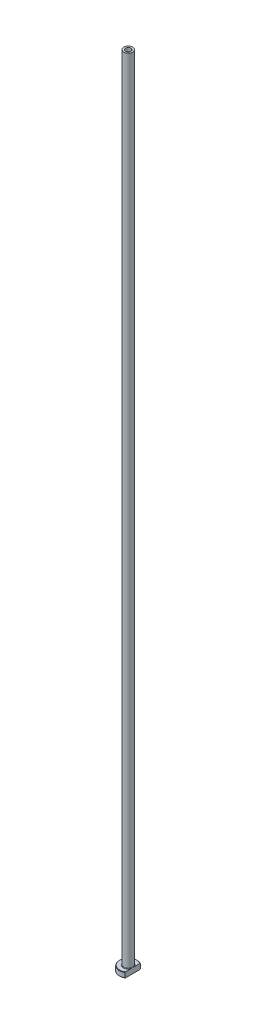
ISO-10303-21;
HEADER;
FILE_DESCRIPTION(('STEP AP214'),'2;1');
FILE_NAME('part.step','',(''),(''),'','','');
FILE_SCHEMA(('AUTOMOTIVE_DESIGN { 1 0 10303 214 1 1 1 1 }'));
ENDSEC;
DATA;
#1=APPLICATION_CONTEXT('core data for automotive mechanical design processes');
#2=APPLICATION_PROTOCOL_DEFINITION('international standard','automotive_design',2000,#1);
#3=PRODUCT_CONTEXT('',#1,'mechanical');
#4=PRODUCT('Part','Part','',(#3));
#5=PRODUCT_RELATED_PRODUCT_CATEGORY('part','',(#4));
#6=PRODUCT_DEFINITION_FORMATION('','',#4);
#7=PRODUCT_DEFINITION_CONTEXT('part definition',#1,'design');
#8=PRODUCT_DEFINITION('design','',#6,#7);
#9=PRODUCT_DEFINITION_SHAPE('','',#8);
#10=(LENGTH_UNIT() NAMED_UNIT(*) SI_UNIT(.MILLI.,.METRE.));
#11=(NAMED_UNIT(*) PLANE_ANGLE_UNIT() SI_UNIT($,.RADIAN.));
#12=(NAMED_UNIT(*) SI_UNIT($,.STERADIAN.) SOLID_ANGLE_UNIT());
#13=UNCERTAINTY_MEASURE_WITH_UNIT(LENGTH_MEASURE(1.E-05),#10,'distance_accuracy_value','');
#14=(GEOMETRIC_REPRESENTATION_CONTEXT(3) GLOBAL_UNCERTAINTY_ASSIGNED_CONTEXT((#13)) GLOBAL_UNIT_ASSIGNED_CONTEXT((#10,
#11,#12)) REPRESENTATION_CONTEXT('',''));
#15=CARTESIAN_POINT('',(0.,0.,0.));
#16=DIRECTION('',(0.,0.,1.));
#17=DIRECTION('',(1.,0.,0.));
#18=AXIS2_PLACEMENT_3D('',#15,#16,#17);
#19=CARTESIAN_POINT('',(0.,92.1876809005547,0.));
#20=DIRECTION('',(0.,1.,0.));
#21=DIRECTION('',(0.,0.,1.));
#22=AXIS2_PLACEMENT_3D('',#19,#20,#21);
#23=CYLINDRICAL_SURFACE('',#22,1.50000000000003);
#24=CARTESIAN_POINT('',(0.,450.,0.));
#25=DIRECTION('',(0.,1.,0.));
#26=DIRECTION('',(0.,0.,1.));
#27=AXIS2_PLACEMENT_3D('',#24,#25,#26);
#28=CIRCLE('',#27,1.50000000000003);
#29=CARTESIAN_POINT('',(0.,450.,1.50000000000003));
#30=VERTEX_POINT('',#29);
#31=EDGE_CURVE('E167',#30,#30,#28,.T.);
#32=ORIENTED_EDGE('',*,*,#31,.T.);
#33=EDGE_LOOP('',(#32));
#34=FACE_BOUND('',#33,.T.);
#35=CARTESIAN_POINT('',(0.,405.,0.));
#36=DIRECTION('',(0.,1.,0.));
#37=DIRECTION('',(0.,0.,1.));
#38=AXIS2_PLACEMENT_3D('',#35,#36,#37);
#39=CIRCLE('',#38,1.50000000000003);
#40=CARTESIAN_POINT('',(0.,405.,1.50000000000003));
#41=VERTEX_POINT('',#40);
#42=EDGE_CURVE('E170',#41,#41,#39,.T.);
#43=ORIENTED_EDGE('',*,*,#42,.F.);
#44=EDGE_LOOP('',(#43));
#45=FACE_BOUND('',#44,.T.);
#46=ADVANCED_FACE('F32',(#34,#45),#23,.F.);
#47=CARTESIAN_POINT('',(-1.50000000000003,450.,0.));
#48=DIRECTION('',(0.,1.,0.));
#49=DIRECTION('',(0.,0.,1.));
#50=AXIS2_PLACEMENT_3D('',#47,#48,#49);
#51=PLANE('',#50);
#52=CARTESIAN_POINT('',(0.,450.,0.));
#53=DIRECTION('',(0.,1.,0.));
#54=DIRECTION('',(0.,0.,1.));
#55=AXIS2_PLACEMENT_3D('',#52,#53,#54);
#56=CIRCLE('',#55,2.50000000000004);
#57=CARTESIAN_POINT('',(0.,450.,2.50000000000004));
#58=VERTEX_POINT('',#57);
#59=EDGE_CURVE('E174',#58,#58,#56,.T.);
#60=ORIENTED_EDGE('',*,*,#59,.T.);
#61=EDGE_LOOP('',(#60));
#62=FACE_BOUND('',#61,.T.);
#63=ORIENTED_EDGE('',*,*,#31,.F.);
#64=EDGE_LOOP('',(#63));
#65=FACE_BOUND('',#64,.T.);
#66=ADVANCED_FACE('F157',(#62,#65),#51,.T.);
#67=CARTESIAN_POINT('',(0.,92.1876809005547,0.));
#68=DIRECTION('',(0.,1.,0.));
#69=DIRECTION('',(0.,0.,1.));
#70=AXIS2_PLACEMENT_3D('',#67,#68,#69);
#71=CYLINDRICAL_SURFACE('',#70,2.50000000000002);
#72=CARTESIAN_POINT('',(0.,3.3,0.));
#73=DIRECTION('',(0.,1.,0.));
#74=DIRECTION('',(0.,0.,1.));
#75=AXIS2_PLACEMENT_3D('',#72,#73,#74);
#76=CIRCLE('',#75,2.50000000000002);
#77=CARTESIAN_POINT('',(2.50000000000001,3.3,0.));
#78=VERTEX_POINT('',#77);
#79=EDGE_CURVE('E180',#78,#78,#76,.T.);
#80=ORIENTED_EDGE('',*,*,#79,.T.);
#81=EDGE_LOOP('',(#80));
#82=FACE_BOUND('',#81,.T.);
#83=ORIENTED_EDGE('',*,*,#59,.F.);
#84=EDGE_LOOP('',(#83));
#85=FACE_BOUND('',#84,.T.);
#86=ADVANCED_FACE('F162',(#82,#85),#71,.T.);
#87=CARTESIAN_POINT('',(-2.49999999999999,3.,0.));
#88=DIRECTION('',(0.,1.,0.));
#89=DIRECTION('',(0.,0.,1.));
#90=AXIS2_PLACEMENT_3D('',#87,#88,#89);
#91=PLANE('',#90);
#92=DIRECTION('',(0.,0.,1.));
#93=VECTOR('',#92,1.);
#94=CARTESIAN_POINT('',(2.5,3.,0.));
#95=LINE('',#94,#93);
#96=CARTESIAN_POINT('',(2.5,3.,-4.09756024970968));
#97=VERTEX_POINT('',#96);
#98=CARTESIAN_POINT('',(2.5,3.,-1.26095202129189));
#99=VERTEX_POINT('',#98);
#100=EDGE_CURVE('E54',#97,#99,#95,.T.);
#101=ORIENTED_EDGE('',*,*,#100,.F.);
#102=CARTESIAN_POINT('',(0.,3.,0.));
#103=DIRECTION('',(0.,1.,0.));
#104=DIRECTION('',(0.,0.,1.));
#105=AXIS2_PLACEMENT_3D('',#102,#103,#104);
#106=CIRCLE('',#105,4.80000000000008);
#107=CARTESIAN_POINT('',(2.49999999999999,3.,4.09756024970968));
#108=VERTEX_POINT('',#107);
#109=EDGE_CURVE('E186',#97,#108,#106,.T.);
#110=ORIENTED_EDGE('',*,*,#109,.T.);
#111=CARTESIAN_POINT('',(2.5,3.,1.2609520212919));
#112=VERTEX_POINT('',#111);
#113=EDGE_CURVE('E134',#112,#108,#95,.T.);
#114=ORIENTED_EDGE('',*,*,#113,.F.);
#115=CARTESIAN_POINT('',(0.,3.,0.));
#116=DIRECTION('',(0.,1.,0.));
#117=DIRECTION('',(0.,0.,1.));
#118=AXIS2_PLACEMENT_3D('',#115,#116,#117);
#119=CIRCLE('',#118,2.80000000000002);
#120=EDGE_CURVE('E183',#112,#99,#119,.F.);
#121=ORIENTED_EDGE('',*,*,#120,.T.);
#122=EDGE_LOOP('',(#101,#110,#114,#121));
#123=FACE_BOUND('',#122,.T.);
#124=ADVANCED_FACE('F197',(#123),#91,.T.);
#125=CARTESIAN_POINT('',(0.,92.1876809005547,0.));
#126=DIRECTION('',(0.,1.,0.));
#127=DIRECTION('',(0.,0.,1.));
#128=AXIS2_PLACEMENT_3D('',#125,#126,#127);
#129=CYLINDRICAL_SURFACE('',#128,4.99999999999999);
#130=DIRECTION('',(0.,-1.,0.));
#131=VECTOR('',#130,1.);
#132=CARTESIAN_POINT('',(2.49999999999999,450.,4.33012701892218));
#133=LINE('',#132,#131);
#134=CARTESIAN_POINT('',(2.49999999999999,2.80000000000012,4.33012701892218));
#135=VERTEX_POINT('',#134);
#136=CARTESIAN_POINT('',(2.49999999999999,0.200000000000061,4.33012701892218));
#137=VERTEX_POINT('',#136);
#138=EDGE_CURVE('E82',#135,#137,#133,.T.);
#139=ORIENTED_EDGE('',*,*,#138,.F.);
#140=CARTESIAN_POINT('',(0.,2.80000000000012,0.));
#141=DIRECTION('',(0.,1.,0.));
#142=DIRECTION('',(0.,0.,1.));
#143=AXIS2_PLACEMENT_3D('',#140,#141,#142);
#144=CIRCLE('',#143,4.99999999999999);
#145=CARTESIAN_POINT('',(2.5,2.80000000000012,-4.33012701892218));
#146=VERTEX_POINT('',#145);
#147=EDGE_CURVE('E95',#135,#146,#144,.F.);
#148=ORIENTED_EDGE('',*,*,#147,.T.);
#149=DIRECTION('',(0.,-1.,0.));
#150=VECTOR('',#149,1.);
#151=CARTESIAN_POINT('',(2.5,450.,-4.33012701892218));
#152=LINE('',#151,#150);
#153=CARTESIAN_POINT('',(2.5,0.200000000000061,-4.33012701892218));
#154=VERTEX_POINT('',#153);
#155=EDGE_CURVE('E192',#146,#154,#152,.T.);
#156=ORIENTED_EDGE('',*,*,#155,.T.);
#157=CARTESIAN_POINT('',(0.,0.200000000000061,0.));
#158=DIRECTION('',(0.,-1.,0.));
#159=DIRECTION('',(0.,0.,-1.));
#160=AXIS2_PLACEMENT_3D('',#157,#158,#159);
#161=CIRCLE('',#160,4.99999999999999);
#162=EDGE_CURVE('E98',#154,#137,#161,.F.);
#163=ORIENTED_EDGE('',*,*,#162,.T.);
#164=EDGE_LOOP('',(#139,#148,#156,#163));
#165=FACE_BOUND('',#164,.T.);
#166=ADVANCED_FACE('F190',(#165),#129,.T.);
#167=CARTESIAN_POINT('',(-4.99999999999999,0.,0.));
#168=DIRECTION('',(0.,-1.,0.));
#169=DIRECTION('',(0.,0.,-1.));
#170=AXIS2_PLACEMENT_3D('',#167,#168,#169);
#171=PLANE('',#170);
#172=CARTESIAN_POINT('',(0.,0.,0.));
#173=DIRECTION('',(0.,-1.,0.));
#174=DIRECTION('',(0.,0.,-1.));
#175=AXIS2_PLACEMENT_3D('',#172,#173,#174);
#176=CIRCLE('',#175,2.24999999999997);
#177=CARTESIAN_POINT('',(0.,0.,-2.24999999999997));
#178=VERTEX_POINT('',#177);
#179=EDGE_CURVE('E40',#178,#178,#176,.F.);
#180=ORIENTED_EDGE('',*,*,#179,.T.);
#181=EDGE_LOOP('',(#180));
#182=FACE_BOUND('',#181,.T.);
#183=DIRECTION('',(0.,0.,-1.));
#184=VECTOR('',#183,1.);
#185=CARTESIAN_POINT('',(2.49999999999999,0.,4.33012701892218));
#186=LINE('',#185,#184);
#187=CARTESIAN_POINT('',(2.49999999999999,0.,4.09756024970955));
#188=VERTEX_POINT('',#187);
#189=CARTESIAN_POINT('',(2.5,0.,-4.09756024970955));
#190=VERTEX_POINT('',#189);
#191=EDGE_CURVE('E47',#188,#190,#186,.T.);
#192=ORIENTED_EDGE('',*,*,#191,.F.);
#193=CARTESIAN_POINT('',(0.,0.,0.));
#194=DIRECTION('',(0.,-1.,0.));
#195=DIRECTION('',(0.,0.,-1.));
#196=AXIS2_PLACEMENT_3D('',#193,#194,#195);
#197=CIRCLE('',#196,4.79999999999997);
#198=EDGE_CURVE('E92',#188,#190,#197,.T.);
#199=ORIENTED_EDGE('',*,*,#198,.T.);
#200=EDGE_LOOP('',(#192,#199));
#201=FACE_BOUND('',#200,.T.);
#202=ADVANCED_FACE('F91',(#182,#201),#171,.T.);
#203=CARTESIAN_POINT('',(0.,92.1876809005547,0.));
#204=DIRECTION('',(0.,1.,0.));
#205=DIRECTION('',(0.,0.,1.));
#206=AXIS2_PLACEMENT_3D('',#203,#204,#205);
#207=CYLINDRICAL_SURFACE('',#206,1.75000000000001);
#208=CARTESIAN_POINT('',(0.,0.499999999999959,0.));
#209=DIRECTION('',(0.,-1.,0.));
#210=DIRECTION('',(0.,0.,-1.));
#211=AXIS2_PLACEMENT_3D('',#208,#209,#210);
#212=CIRCLE('',#211,1.75000000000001);
#213=CARTESIAN_POINT('',(0.,0.499999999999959,-1.75000000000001));
#214=VERTEX_POINT('',#213);
#215=EDGE_CURVE('E11',#214,#214,#212,.T.);
#216=ORIENTED_EDGE('',*,*,#215,.T.);
#217=EDGE_LOOP('',(#216));
#218=FACE_BOUND('',#217,.T.);
#219=CARTESIAN_POINT('',(0.,393.,0.));
#220=DIRECTION('',(0.,1.,0.));
#221=DIRECTION('',(0.,0.,1.));
#222=AXIS2_PLACEMENT_3D('',#219,#220,#221);
#223=CIRCLE('',#222,1.75000000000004);
#224=CARTESIAN_POINT('',(0.,393.,1.75000000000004));
#225=VERTEX_POINT('',#224);
#226=EDGE_CURVE('E172',#225,#225,#223,.T.);
#227=ORIENTED_EDGE('',*,*,#226,.T.);
#228=EDGE_LOOP('',(#227));
#229=FACE_BOUND('',#228,.T.);
#230=ADVANCED_FACE('F215',(#218,#229),#207,.F.);
#231=CARTESIAN_POINT('',(0.,393.,0.));
#232=DIRECTION('',(0.,-1.,0.));
#233=DIRECTION('',(0.,0.,-1.));
#234=AXIS2_PLACEMENT_3D('',#231,#232,#233);
#235=CONICAL_SURFACE('',#234,1.75000000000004,0.0208303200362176);
#236=ORIENTED_EDGE('',*,*,#42,.T.);
#237=EDGE_LOOP('',(#236));
#238=FACE_BOUND('',#237,.T.);
#239=ORIENTED_EDGE('',*,*,#226,.F.);
#240=EDGE_LOOP('',(#239));
#241=FACE_BOUND('',#240,.T.);
#242=ADVANCED_FACE('F111',(#238,#241),#235,.F.);
#243=CARTESIAN_POINT('',(0.,3.3,0.));
#244=DIRECTION('',(0.,1.,0.));
#245=DIRECTION('',(0.,0.,1.));
#246=AXIS2_PLACEMENT_3D('',#243,#244,#245);
#247=TOROIDAL_SURFACE('',#246,2.80000000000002,0.3);
#248=ORIENTED_EDGE('',*,*,#120,.F.);
#249=CARTESIAN_POINT('',(2.50000000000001,3.3,0.));
#250=CARTESIAN_POINT('',(2.50000000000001,3.30000062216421,-4.84329920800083E-11));
#251=CARTESIAN_POINT('',(2.50000000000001,3.30000124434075,1.59621222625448E-07));
#252=CARTESIAN_POINT('',(2.50000000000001,3.30000243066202,6.45478408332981E-07));
#253=CARTESIAN_POINT('',(2.50000000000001,3.30000299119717,9.78481278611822E-07));
#254=CARTESIAN_POINT('',(2.50000000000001,3.30000411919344,1.77472066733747E-06));
#255=CARTESIAN_POINT('',(2.50000000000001,3.30000467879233,2.24902247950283E-06));
#256=CARTESIAN_POINT('',(2.50000000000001,3.30000572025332,3.25953805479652E-06));
#257=CARTESIAN_POINT('',(2.50000000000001,3.3000062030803,3.79480870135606E-06));
#258=CARTESIAN_POINT('',(2.50000000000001,3.3000078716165,5.75794837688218E-06));
#259=CARTESIAN_POINT('',(2.5,3.30000896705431,7.26424379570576E-06));
#260=CARTESIAN_POINT('',(2.5,3.30001087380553,1.0336116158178E-05));
#261=CARTESIAN_POINT('',(2.5,3.30001169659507,1.18949530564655E-05));
#262=CARTESIAN_POINT('',(2.5,3.30001489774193,1.81400905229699E-05));
#263=CARTESIAN_POINT('',(2.5,3.30001712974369,2.29062248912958E-05));
#264=CARTESIAN_POINT('',(2.5,3.30002067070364,3.21793951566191E-05));
#265=CARTESIAN_POINT('',(2.5,3.30002205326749,3.66589069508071E-05));
#266=CARTESIAN_POINT('',(2.5,3.30002810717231,5.61718533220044E-05));
#267=CARTESIAN_POINT('',(2.5,3.30003284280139,7.1173604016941E-05));
#268=CARTESIAN_POINT('',(2.5,3.30004025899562,9.8992053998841E-05));
#269=CARTESIAN_POINT('',(2.5,3.30004315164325,0.000111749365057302));
#270=CARTESIAN_POINT('',(2.49999999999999,3.30006652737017,0.0002062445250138));
#271=CARTESIAN_POINT('',(2.49999999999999,3.30009698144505,0.000285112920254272));
#272=CARTESIAN_POINT('',(2.5,3.30021213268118,0.000594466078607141));
#273=CARTESIAN_POINT('',(2.5,3.3002893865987,0.000826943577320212));
#274=CARTESIAN_POINT('',(2.49999999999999,3.30059681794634,0.00173885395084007));
#275=CARTESIAN_POINT('',(2.49999999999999,3.30083479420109,0.00241625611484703));
#276=CARTESIAN_POINT('',(2.5,3.30181198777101,0.00521069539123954));
#277=CARTESIAN_POINT('',(2.5,3.30254240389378,0.00732996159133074));
#278=CARTESIAN_POINT('',(2.49999999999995,3.3122604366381,0.035509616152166));
#279=CARTESIAN_POINT('',(2.49999999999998,3.32130808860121,0.061555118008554));
#280=CARTESIAN_POINT('',(2.50000000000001,3.33896212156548,0.112677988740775));
#281=CARTESIAN_POINT('',(2.5,3.34757212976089,0.137754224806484));
#282=CARTESIAN_POINT('',(2.49999999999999,3.36573068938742,0.19098188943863));
#283=CARTESIAN_POINT('',(2.49999999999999,3.37526654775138,0.219137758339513));
#284=CARTESIAN_POINT('',(2.5,3.39422867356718,0.275816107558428));
#285=CARTESIAN_POINT('',(2.5,3.40365272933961,0.30433932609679));
#286=CARTESIAN_POINT('',(2.49999999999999,3.42641697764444,0.374416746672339));
#287=CARTESIAN_POINT('',(2.5,3.43959811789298,0.416023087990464));
#288=CARTESIAN_POINT('',(2.5,3.46479157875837,0.498481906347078));
#289=CARTESIAN_POINT('',(2.5,3.47682455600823,0.539328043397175));
#290=CARTESIAN_POINT('',(2.5,3.50224427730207,0.629981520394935));
#291=CARTESIAN_POINT('',(2.5,3.51538048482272,0.679860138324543));
#292=CARTESIAN_POINT('',(2.5,3.53964074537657,0.780511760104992));
#293=CARTESIAN_POINT('',(2.5,3.55074877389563,0.831288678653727));
#294=CARTESIAN_POINT('',(2.5,3.57087054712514,0.937063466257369));
#295=CARTESIAN_POINT('',(2.5,3.57967623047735,0.992102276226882));
#296=CARTESIAN_POINT('',(2.5,3.59301148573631,1.10256024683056));
#297=CARTESIAN_POINT('',(2.5,3.59755297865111,1.15797790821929));
#298=CARTESIAN_POINT('',(2.5,3.60093314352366,1.26786705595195));
#299=CARTESIAN_POINT('',(2.5,3.5998936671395,1.32233291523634));
#300=CARTESIAN_POINT('',(2.5,3.5927727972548,1.40310062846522));
#301=CARTESIAN_POINT('',(2.5,3.58952137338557,1.42965222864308));
#302=CARTESIAN_POINT('',(2.5,3.58085857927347,1.48239078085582));
#303=CARTESIAN_POINT('',(2.5,3.57544928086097,1.50857805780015));
#304=CARTESIAN_POINT('',(2.5,3.56298810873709,1.55658799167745));
#305=CARTESIAN_POINT('',(2.5,3.55628200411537,1.57849902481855));
#306=CARTESIAN_POINT('',(2.5,3.54055393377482,1.62160292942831));
#307=CARTESIAN_POINT('',(2.5,3.53152220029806,1.64279233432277));
#308=CARTESIAN_POINT('',(2.5,3.51057199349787,1.68404469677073));
#309=CARTESIAN_POINT('',(2.5,3.4986201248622,1.70409105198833));
#310=CARTESIAN_POINT('',(2.5,3.47134074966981,1.7417209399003));
#311=CARTESIAN_POINT('',(2.5,3.45603127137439,1.75931683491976));
#312=CARTESIAN_POINT('',(2.5,3.42979930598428,1.78297070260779));
#313=CARTESIAN_POINT('',(2.5,3.42024268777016,1.79054141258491));
#314=CARTESIAN_POINT('',(2.5,3.40009035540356,1.80416997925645));
#315=CARTESIAN_POINT('',(2.5,3.38949499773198,1.81022835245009));
#316=CARTESIAN_POINT('',(2.5,3.36727740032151,1.82047087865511));
#317=CARTESIAN_POINT('',(2.5,3.35564531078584,1.82463409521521));
#318=CARTESIAN_POINT('',(2.5,3.33178837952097,1.83058442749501));
#319=CARTESIAN_POINT('',(2.5,3.31956435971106,1.83237474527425));
#320=CARTESIAN_POINT('',(2.5,3.29665736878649,1.83331852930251));
#321=CARTESIAN_POINT('',(2.5,3.28598670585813,1.83279233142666));
#322=CARTESIAN_POINT('',(2.5,3.26490749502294,1.82986307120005));
#323=CARTESIAN_POINT('',(2.5,3.25449899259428,1.82745968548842));
#324=CARTESIAN_POINT('',(2.5,3.23467098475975,1.82111257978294));
#325=CARTESIAN_POINT('',(2.5,3.2252281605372,1.81724026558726));
#326=CARTESIAN_POINT('',(2.5,3.20699535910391,1.80819497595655));
#327=CARTESIAN_POINT('',(2.5,3.198205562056,1.8030216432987));
#328=CARTESIAN_POINT('',(2.5,3.17663162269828,1.78842115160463));
#329=CARTESIAN_POINT('',(2.5,3.16436228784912,1.7782329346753));
#330=CARTESIAN_POINT('',(2.5,3.14157828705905,1.75604629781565));
#331=CARTESIAN_POINT('',(2.5,3.13106906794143,1.74404246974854));
#332=CARTESIAN_POINT('',(2.5,3.10600520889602,1.7114211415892));
#333=CARTESIAN_POINT('',(2.5,3.09267476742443,1.6898688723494));
#334=CARTESIAN_POINT('',(2.5,3.06940323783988,1.64508572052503));
#335=CARTESIAN_POINT('',(2.5,3.05946314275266,1.62185434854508));
#336=CARTESIAN_POINT('',(2.5,3.03545750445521,1.55546754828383));
#337=CARTESIAN_POINT('',(2.5,3.0244402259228,1.51122187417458));
#338=CARTESIAN_POINT('',(2.5,3.00863926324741,1.42119777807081));
#339=CARTESIAN_POINT('',(2.5,3.00393876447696,1.37540689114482));
#340=CARTESIAN_POINT('',(2.5,2.99924212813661,1.28072198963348));
#341=CARTESIAN_POINT('',(2.5,2.99956098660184,1.2318142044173));
#342=CARTESIAN_POINT('',(2.5,3.00436098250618,1.1341094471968));
#343=CARTESIAN_POINT('',(2.5,3.008853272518,1.08531312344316));
#344=CARTESIAN_POINT('',(2.5,3.02074191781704,0.990773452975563));
#345=CARTESIAN_POINT('',(2.5,3.02796792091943,0.945007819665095));
#346=CARTESIAN_POINT('',(2.5,3.04465555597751,0.854199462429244));
#347=CARTESIAN_POINT('',(2.5,3.05410250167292,0.809153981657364));
#348=CARTESIAN_POINT('',(2.5,3.07710029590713,0.709411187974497));
#349=CARTESIAN_POINT('',(2.5,3.09109633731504,0.654817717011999));
#350=CARTESIAN_POINT('',(2.5,3.12140740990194,0.544863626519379));
#351=CARTESIAN_POINT('',(2.49999999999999,3.13777040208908,0.489516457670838));
#352=CARTESIAN_POINT('',(2.5,3.1664954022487,0.396740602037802));
#353=CARTESIAN_POINT('',(2.5,3.17848130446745,0.359193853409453));
#354=CARTESIAN_POINT('',(2.49999999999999,3.20280507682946,0.284651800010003));
#355=CARTESIAN_POINT('',(2.49999999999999,3.21513791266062,0.24765485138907));
#356=CARTESIAN_POINT('',(2.5,3.23873713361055,0.17776725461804));
#357=CARTESIAN_POINT('',(2.50000000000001,3.24997409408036,0.144866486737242));
#358=CARTESIAN_POINT('',(2.49999999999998,3.27307149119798,0.0777985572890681));
#359=CARTESIAN_POINT('',(2.49999999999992,3.28493883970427,0.0436336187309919));
#360=CARTESIAN_POINT('',(2.5,3.29745794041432,0.00732879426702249));
#361=CARTESIAN_POINT('',(2.50000000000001,3.29818879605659,0.0052083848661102));
#362=CARTESIAN_POINT('',(2.49999999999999,3.29916610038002,0.00241367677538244));
#363=CARTESIAN_POINT('',(2.49999999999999,3.29940376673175,0.00173715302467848));
#364=CARTESIAN_POINT('',(2.5,3.29971082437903,0.000826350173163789));
#365=CARTESIAN_POINT('',(2.5,3.29978800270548,0.000594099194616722));
#366=CARTESIAN_POINT('',(2.49999999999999,3.29990305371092,0.000285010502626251));
#367=CARTESIAN_POINT('',(2.49999999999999,3.29993349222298,0.000206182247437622));
#368=CARTESIAN_POINT('',(2.5,3.29995685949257,0.000111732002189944));
#369=CARTESIAN_POINT('',(2.5,3.29995975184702,9.89774534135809E-05));
#370=CARTESIAN_POINT('',(2.5,3.29996716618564,7.11652057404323E-05));
#371=CARTESIAN_POINT('',(2.5,3.29997189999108,5.61668223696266E-05));
#372=CARTESIAN_POINT('',(2.5,3.29997795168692,3.66576408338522E-05));
#373=CARTESIAN_POINT('',(2.5,3.2999793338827,3.2178532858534E-05));
#374=CARTESIAN_POINT('',(2.5,3.2999828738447,2.29061444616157E-05));
#375=CARTESIAN_POINT('',(2.5,3.29998510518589,1.81403713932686E-05));
#376=CARTESIAN_POINT('',(2.50000000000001,3.29998830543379,1.18955853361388E-05));
#377=CARTESIAN_POINT('',(2.50000000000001,3.29998912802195,1.03367793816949E-05));
#378=CARTESIAN_POINT('',(2.50000000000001,3.29999103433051,7.26493051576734E-06));
#379=CARTESIAN_POINT('',(2.50000000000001,3.29999212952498,5.75862492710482E-06));
#380=CARTESIAN_POINT('',(2.50000000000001,3.29999379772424,3.79542597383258E-06));
#381=CARTESIAN_POINT('',(2.50000000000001,3.29999428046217,3.260128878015E-06));
#382=CARTESIAN_POINT('',(2.50000000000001,3.29999532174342,2.24954437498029E-06));
#383=CARTESIAN_POINT('',(2.50000000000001,3.29999588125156,1.7751998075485E-06));
#384=CARTESIAN_POINT('',(2.50000000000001,3.29999700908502,9.78857672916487E-07));
#385=CARTESIAN_POINT('',(2.50000000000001,3.29999756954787,6.45797504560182E-07));
#386=CARTESIAN_POINT('',(2.50000000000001,3.29999875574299,1.59799784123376E-07));
#387=CARTESIAN_POINT('',(2.50000000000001,3.29999937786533,4.84311931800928E-11));
#388=CARTESIAN_POINT('',(2.50000000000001,3.3,0.));
#389=B_SPLINE_CURVE_WITH_KNOTS('',3,(#249,#250,#251,#252,#253,#254,#255,#256,#257,#258,#259,
#260,#261,#262,#263,#264,#265,#266,#267,#268,#269,#270,#271,#272,#273,#274,#275,#276,#277,#278,
#279,#280,#281,#282,#283,#284,#285,#286,#287,#288,#289,#290,#291,#292,#293,#294,#295,#296,#297,
#298,#299,#300,#301,#302,#303,#304,#305,#306,#307,#308,#309,#310,#311,#312,#313,#314,#315,#316,
#317,#318,#319,#320,#321,#322,#323,#324,#325,#326,#327,#328,#329,#330,#331,#332,#333,#334,#335,
#336,#337,#338,#339,#340,#341,#342,#343,#344,#345,#346,#347,#348,#349,#350,#351,#352,#353,#354,
#355,#356,#357,#358,#359,#360,#361,#362,#363,#364,#365,#366,#367,#368,#369,#370,#371,#372,#373,
#374,#375,#376,#377,#378,#379,#380,#381,#382,#383,#384,#385,#386,#387,#388),.UNSPECIFIED.,.T.,
.F.,(4,2,2,2,2,2,2,2,2,2,2,2,2,2,2,2,2,2,2,2,2,2,2,2,2,2,2,2,2,2,2,2,2,2,2,2,2,2,2,2,2,2,2,2,2,
2,2,2,2,2,2,2,2,2,2,2,2,2,2,2,2,2,2,2,2,2,2,2,2,4),(0.,1.8678891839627E-06,3.81549021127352E-06,
6.00609677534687E-06,8.16651954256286E-06,1.37285468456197E-05,1.90122017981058E-05,
3.47597138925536E-05,4.88082426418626E-05,9.59978318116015E-05,0.000135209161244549,
0.000388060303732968,0.00112364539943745,0.00327678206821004,0.0100024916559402,
0.0927120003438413,0.172253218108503,0.261432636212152,0.351551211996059,0.482477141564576,
0.610212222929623,0.764915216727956,0.920792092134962,1.08787897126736,1.25449733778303,
1.41749285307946,1.49767530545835,1.57778095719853,1.64642481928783,1.71536183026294,
1.78512750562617,1.85452737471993,1.89099315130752,1.92744645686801,1.96429324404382,
2.00109025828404,2.03297105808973,2.06485735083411,2.0953592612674,2.12586955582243,
2.17344034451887,2.22115572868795,2.29675134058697,2.37236907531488,2.50839721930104,
2.64619971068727,2.79268284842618,2.93955855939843,3.07848421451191,3.21651583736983,
3.38554045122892,3.55865938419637,3.67689643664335,3.79388863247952,3.89819085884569,
4.00668323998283,4.01341261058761,4.01556295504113,4.01629782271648,4.01655054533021,
4.01658974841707,4.0166369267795,4.01665097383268,4.01666671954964,4.01667200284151,
4.01667756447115,4.01667972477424,4.01668191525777,4.01668386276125,4.01668573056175),.UNSPECIFIED.);
#390=EDGE_CURVE('E126',#112,#78,#389,.T.);
#391=ORIENTED_EDGE('',*,*,#390,.T.);
#392=ORIENTED_EDGE('',*,*,#79,.F.);
#393=CARTESIAN_POINT('',(2.50000000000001,3.3,0.));
#394=CARTESIAN_POINT('',(2.50000000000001,3.29999937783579,4.84334780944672E-11));
#395=CARTESIAN_POINT('',(2.50000000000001,3.29999875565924,-1.59621222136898E-07));
#396=CARTESIAN_POINT('',(2.50000000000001,3.29999756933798,-6.45478407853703E-07));
#397=CARTESIAN_POINT('',(2.50000000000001,3.29999700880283,-9.78481278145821E-07));
#398=CARTESIAN_POINT('',(2.50000000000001,3.29999588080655,-1.77472066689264E-06));
#399=CARTESIAN_POINT('',(2.50000000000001,3.29999532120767,-2.24902247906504E-06));
#400=CARTESIAN_POINT('',(2.50000000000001,3.29999427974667,-3.25953805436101E-06));
#401=CARTESIAN_POINT('',(2.50000000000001,3.29999379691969,-3.79480870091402E-06));
#402=CARTESIAN_POINT('',(2.50000000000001,3.29999212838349,-5.75794837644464E-06));
#403=CARTESIAN_POINT('',(2.50000000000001,3.29999103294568,-7.2642437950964E-06));
#404=CARTESIAN_POINT('',(2.50000000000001,3.29998912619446,-1.03361161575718E-05));
#405=CARTESIAN_POINT('',(2.50000000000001,3.29998830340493,-1.18949530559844E-05));
#406=CARTESIAN_POINT('',(2.5,3.29998510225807,-1.81400905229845E-05));
#407=CARTESIAN_POINT('',(2.5,3.29998287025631,-2.29062248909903E-05));
#408=CARTESIAN_POINT('',(2.5,3.29997932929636,-3.21793951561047E-05));
#409=CARTESIAN_POINT('',(2.5,3.2999779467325,-3.66589069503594E-05));
#410=CARTESIAN_POINT('',(2.5,3.29997189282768,-5.61718533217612E-05));
#411=CARTESIAN_POINT('',(2.5,3.2999671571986,-7.11736040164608E-05));
#412=CARTESIAN_POINT('',(2.5,3.29995974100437,-9.89920539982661E-05));
#413=CARTESIAN_POINT('',(2.5,3.29995684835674,-0.000111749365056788));
#414=CARTESIAN_POINT('',(2.49999999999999,3.29993347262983,-0.000206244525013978));
#415=CARTESIAN_POINT('',(2.49999999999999,3.29990301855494,-0.000285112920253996));
#416=CARTESIAN_POINT('',(2.5,3.29978786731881,-0.000594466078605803));
#417=CARTESIAN_POINT('',(2.5,3.29971061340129,-0.000826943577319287));
#418=CARTESIAN_POINT('',(2.49999999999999,3.29940318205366,-0.00173885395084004));
#419=CARTESIAN_POINT('',(2.49999999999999,3.29916520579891,-0.00241625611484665));
#420=CARTESIAN_POINT('',(2.5,3.29818801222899,-0.00521069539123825));
#421=CARTESIAN_POINT('',(2.5,3.29745759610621,-0.00732996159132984));
#422=CARTESIAN_POINT('',(2.49999999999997,3.28773956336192,-0.0355096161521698));
#423=CARTESIAN_POINT('',(2.49999999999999,3.27869191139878,-0.0615551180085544));
#424=CARTESIAN_POINT('',(2.5,3.26103787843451,-0.112677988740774));
#425=CARTESIAN_POINT('',(2.5,3.2524278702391,-0.137754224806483));
#426=CARTESIAN_POINT('',(2.49999999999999,3.23426931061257,-0.19098188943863));
#427=CARTESIAN_POINT('',(2.49999999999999,3.22473345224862,-0.219137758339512));
#428=CARTESIAN_POINT('',(2.5,3.20577132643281,-0.275816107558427));
#429=CARTESIAN_POINT('',(2.5,3.19634727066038,-0.304339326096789));
#430=CARTESIAN_POINT('',(2.49999999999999,3.17358302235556,-0.374416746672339));
#431=CARTESIAN_POINT('',(2.5,3.16040188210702,-0.416023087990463));
#432=CARTESIAN_POINT('',(2.5,3.13520842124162,-0.498481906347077));
#433=CARTESIAN_POINT('',(2.5,3.12317544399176,-0.539328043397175));
#434=CARTESIAN_POINT('',(2.5,3.09775572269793,-0.629981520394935));
#435=CARTESIAN_POINT('',(2.5,3.08461951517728,-0.679860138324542));
#436=CARTESIAN_POINT('',(2.5,3.06035925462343,-0.780511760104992));
#437=CARTESIAN_POINT('',(2.5,3.04925122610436,-0.831288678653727));
#438=CARTESIAN_POINT('',(2.5,3.02912945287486,-0.937063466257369));
#439=CARTESIAN_POINT('',(2.5,3.02032376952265,-0.992102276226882));
#440=CARTESIAN_POINT('',(2.5,3.00698851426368,-1.10256024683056));
#441=CARTESIAN_POINT('',(2.5,3.00244702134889,-1.15797790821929));
#442=CARTESIAN_POINT('',(2.5,2.99906685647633,-1.26786705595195));
#443=CARTESIAN_POINT('',(2.5,3.00010633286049,-1.32233291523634));
#444=CARTESIAN_POINT('',(2.5,3.0072272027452,-1.40310062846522));
#445=CARTESIAN_POINT('',(2.5,3.01047862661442,-1.42965222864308));
#446=CARTESIAN_POINT('',(2.5,3.01914142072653,-1.48239078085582));
#447=CARTESIAN_POINT('',(2.5,3.02455071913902,-1.50857805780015));
#448=CARTESIAN_POINT('',(2.5,3.0370118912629,-1.55658799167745));
#449=CARTESIAN_POINT('',(2.5,3.04371799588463,-1.57849902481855));
#450=CARTESIAN_POINT('',(2.5,3.05944606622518,-1.62160292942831));
#451=CARTESIAN_POINT('',(2.5,3.06847779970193,-1.64279233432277));
#452=CARTESIAN_POINT('',(2.5,3.08942800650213,-1.68404469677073));
#453=CARTESIAN_POINT('',(2.5,3.10137987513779,-1.70409105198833));
#454=CARTESIAN_POINT('',(2.5,3.12865925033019,-1.7417209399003));
#455=CARTESIAN_POINT('',(2.5,3.1439687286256,-1.75931683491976));
#456=CARTESIAN_POINT('',(2.5,3.17020069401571,-1.78297070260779));
#457=CARTESIAN_POINT('',(2.5,3.17975731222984,-1.79054141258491));
#458=CARTESIAN_POINT('',(2.5,3.19990964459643,-1.80416997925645));
#459=CARTESIAN_POINT('',(2.5,3.21050500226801,-1.81022835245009));
#460=CARTESIAN_POINT('',(2.5,3.23272259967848,-1.82047087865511));
#461=CARTESIAN_POINT('',(2.5,3.24435468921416,-1.82463409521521));
#462=CARTESIAN_POINT('',(2.5,3.26821162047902,-1.83058442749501));
#463=CARTESIAN_POINT('',(2.5,3.28043564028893,-1.83237474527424));
#464=CARTESIAN_POINT('',(2.5,3.30334263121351,-1.83331852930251));
#465=CARTESIAN_POINT('',(2.5,3.31401329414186,-1.83279233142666));
#466=CARTESIAN_POINT('',(2.5,3.33509250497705,-1.82986307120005));
#467=CARTESIAN_POINT('',(2.5,3.34550100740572,-1.82745968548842));
#468=CARTESIAN_POINT('',(2.5,3.36532901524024,-1.82111257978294));
#469=CARTESIAN_POINT('',(2.5,3.37477183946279,-1.81724026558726));
#470=CARTESIAN_POINT('',(2.5,3.39300464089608,-1.80819497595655));
#471=CARTESIAN_POINT('',(2.5,3.40179443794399,-1.80302164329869));
#472=CARTESIAN_POINT('',(2.5,3.42336837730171,-1.78842115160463));
#473=CARTESIAN_POINT('',(2.5,3.43563771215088,-1.7782329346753));
#474=CARTESIAN_POINT('',(2.5,3.45842171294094,-1.75604629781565));
#475=CARTESIAN_POINT('',(2.5,3.46893093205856,-1.74404246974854));
#476=CARTESIAN_POINT('',(2.5,3.49399479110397,-1.7114211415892));
#477=CARTESIAN_POINT('',(2.5,3.50732523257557,-1.6898688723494));
#478=CARTESIAN_POINT('',(2.5,3.53059676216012,-1.64508572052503));
#479=CARTESIAN_POINT('',(2.5,3.54053685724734,-1.62185434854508));
#480=CARTESIAN_POINT('',(2.5,3.56454249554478,-1.55546754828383));
#481=CARTESIAN_POINT('',(2.5,3.5755597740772,-1.51122187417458));
#482=CARTESIAN_POINT('',(2.5,3.59136073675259,-1.4211977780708));
#483=CARTESIAN_POINT('',(2.5,3.59606123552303,-1.37540689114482));
#484=CARTESIAN_POINT('',(2.5,3.60075787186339,-1.28072198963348));
#485=CARTESIAN_POINT('',(2.5,3.60043901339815,-1.2318142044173));
#486=CARTESIAN_POINT('',(2.5,3.59563901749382,-1.1341094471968));
#487=CARTESIAN_POINT('',(2.5,3.591146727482,-1.08531312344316));
#488=CARTESIAN_POINT('',(2.5,3.57925808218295,-0.99077345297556));
#489=CARTESIAN_POINT('',(2.5,3.57203207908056,-0.945007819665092));
#490=CARTESIAN_POINT('',(2.5,3.55534444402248,-0.85419946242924));
#491=CARTESIAN_POINT('',(2.5,3.54589749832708,-0.80915398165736));
#492=CARTESIAN_POINT('',(2.5,3.52289970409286,-0.709411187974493));
#493=CARTESIAN_POINT('',(2.5,3.50890366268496,-0.654817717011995));
#494=CARTESIAN_POINT('',(2.5,3.47859259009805,-0.544863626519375));
#495=CARTESIAN_POINT('',(2.49999999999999,3.46222959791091,-0.489516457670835));
#496=CARTESIAN_POINT('',(2.5,3.4335045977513,-0.396740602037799));
#497=CARTESIAN_POINT('',(2.5,3.42151869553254,-0.359193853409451));
#498=CARTESIAN_POINT('',(2.49999999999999,3.39719492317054,-0.284651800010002));
#499=CARTESIAN_POINT('',(2.49999999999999,3.38486208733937,-0.24765485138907));
#500=CARTESIAN_POINT('',(2.5,3.36126286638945,-0.177767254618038));
#501=CARTESIAN_POINT('',(2.50000000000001,3.35002590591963,-0.144866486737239));
#502=CARTESIAN_POINT('',(2.49999999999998,3.32692850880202,-0.0777985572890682));
#503=CARTESIAN_POINT('',(2.49999999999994,3.31506116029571,-0.0436336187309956));
#504=CARTESIAN_POINT('',(2.5,3.30254205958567,-0.00732879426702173));
#505=CARTESIAN_POINT('',(2.5,3.30181120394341,-0.00520838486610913));
#506=CARTESIAN_POINT('',(2.49999999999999,3.30083389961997,-0.00241367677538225));
#507=CARTESIAN_POINT('',(2.49999999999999,3.30059623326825,-0.00173715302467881));
#508=CARTESIAN_POINT('',(2.5,3.30028917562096,-0.000826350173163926));
#509=CARTESIAN_POINT('',(2.5,3.30021199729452,-0.000594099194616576));
#510=CARTESIAN_POINT('',(2.49999999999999,3.30009694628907,-0.000285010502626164));
#511=CARTESIAN_POINT('',(2.49999999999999,3.30006650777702,-0.000206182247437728));
#512=CARTESIAN_POINT('',(2.5,3.30004314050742,-0.000111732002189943));
#513=CARTESIAN_POINT('',(2.5,3.30004024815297,-9.8977453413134E-05));
#514=CARTESIAN_POINT('',(2.5,3.30003283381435,-7.11652057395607E-05));
#515=CARTESIAN_POINT('',(2.5,3.30002810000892,-5.61668223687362E-05));
#516=CARTESIAN_POINT('',(2.5,3.30002204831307,-3.66576408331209E-05));
#517=CARTESIAN_POINT('',(2.5,3.3000206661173,-3.21785328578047E-05));
#518=CARTESIAN_POINT('',(2.5,3.30001712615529,-2.29061444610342E-05));
#519=CARTESIAN_POINT('',(2.5,3.3000148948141,-1.81403713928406E-05));
#520=CARTESIAN_POINT('',(2.50000000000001,3.3000116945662,-1.18955853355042E-05));
#521=CARTESIAN_POINT('',(2.50000000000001,3.30001087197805,-1.03367793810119E-05));
#522=CARTESIAN_POINT('',(2.50000000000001,3.30000896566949,-7.26493051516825E-06));
#523=CARTESIAN_POINT('',(2.50000000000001,3.30000787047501,-5.7586249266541E-06));
#524=CARTESIAN_POINT('',(2.50000000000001,3.30000620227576,-3.79542597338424E-06));
#525=CARTESIAN_POINT('',(2.50000000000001,3.30000571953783,-3.26012887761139E-06));
#526=CARTESIAN_POINT('',(2.50000000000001,3.30000467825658,-2.24954437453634E-06));
#527=CARTESIAN_POINT('',(2.50000000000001,3.30000411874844,-1.77519980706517E-06));
#528=CARTESIAN_POINT('',(2.50000000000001,3.30000299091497,-9.78857672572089E-07));
#529=CARTESIAN_POINT('',(2.50000000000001,3.30000243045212,-6.45797504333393E-07));
#530=CARTESIAN_POINT('',(2.50000000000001,3.30000124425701,-1.59799783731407E-07));
#531=CARTESIAN_POINT('',(2.50000000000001,3.30000062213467,-4.84306776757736E-11));
#532=CARTESIAN_POINT('',(2.50000000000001,3.3,0.));
#533=B_SPLINE_CURVE_WITH_KNOTS('',3,(#393,#394,#395,#396,#397,#398,#399,#400,#401,#402,#403,
#404,#405,#406,#407,#408,#409,#410,#411,#412,#413,#414,#415,#416,#417,#418,#419,#420,#421,#422,
#423,#424,#425,#426,#427,#428,#429,#430,#431,#432,#433,#434,#435,#436,#437,#438,#439,#440,#441,
#442,#443,#444,#445,#446,#447,#448,#449,#450,#451,#452,#453,#454,#455,#456,#457,#458,#459,#460,
#461,#462,#463,#464,#465,#466,#467,#468,#469,#470,#471,#472,#473,#474,#475,#476,#477,#478,#479,
#480,#481,#482,#483,#484,#485,#486,#487,#488,#489,#490,#491,#492,#493,#494,#495,#496,#497,#498,
#499,#500,#501,#502,#503,#504,#505,#506,#507,#508,#509,#510,#511,#512,#513,#514,#515,#516,#517,
#518,#519,#520,#521,#522,#523,#524,#525,#526,#527,#528,#529,#530,#531,#532),.UNSPECIFIED.,.T.,
.F.,(4,2,2,2,2,2,2,2,2,2,2,2,2,2,2,2,2,2,2,2,2,2,2,2,2,2,2,2,2,2,2,2,2,2,2,2,2,2,2,2,2,2,2,2,2,
2,2,2,2,2,2,2,2,2,2,2,2,2,2,2,2,2,2,2,2,2,2,2,2,4),(0.,1.86788918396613E-06,
3.81549021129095E-06,6.00609677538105E-06,8.16651954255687E-06,1.37285468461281E-05,
1.9012201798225E-05,3.47597138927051E-05,4.88082426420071E-05,9.59978318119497E-05,
0.000135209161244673,0.000388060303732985,0.00112364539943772,0.00327678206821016,
0.0100024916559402,0.0927120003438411,0.172253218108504,0.261432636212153,0.351551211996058,
0.482477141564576,0.610212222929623,0.764915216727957,0.920792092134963,1.08787897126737,
1.25449733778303,1.41749285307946,1.49767530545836,1.57778095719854,1.64642481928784,
1.71536183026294,1.78512750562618,1.85452737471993,1.89099315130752,1.92744645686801,
1.96429324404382,2.00109025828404,2.03297105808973,2.06485735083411,2.0953592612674,
2.12586955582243,2.17344034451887,2.22115572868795,2.29675134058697,2.37236907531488,
2.50839721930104,2.64619971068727,2.79268284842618,2.93955855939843,3.07848421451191,
3.21651583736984,3.38554045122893,3.55865938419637,3.67689643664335,3.79388863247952,
3.89819085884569,4.00668323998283,4.01341261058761,4.01556295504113,4.01629782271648,
4.01655054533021,4.01658974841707,4.0166369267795,4.01665097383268,4.01666671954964,
4.01667200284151,4.01667756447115,4.01667972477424,4.01668191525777,4.01668386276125,
4.01668573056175),.UNSPECIFIED.);
#534=EDGE_CURVE('E135',#78,#99,#533,.T.);
#535=ORIENTED_EDGE('',*,*,#534,.T.);
#536=EDGE_LOOP('',(#248,#391,#392,#535));
#537=FACE_BOUND('',#536,.T.);
#538=ADVANCED_FACE('F141',(#537),#247,.F.);
#539=CARTESIAN_POINT('',(0.,3.,0.));
#540=DIRECTION('',(0.,-1.,0.));
#541=DIRECTION('',(0.,0.,-1.));
#542=AXIS2_PLACEMENT_3D('',#539,#540,#541);
#543=CONICAL_SURFACE('',#542,4.80000000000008,0.785398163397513);
#544=CARTESIAN_POINT('',(2.5,-2.05039133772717,-9.52786489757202));
#545=CARTESIAN_POINT('',(2.5,-1.84160367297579,-9.31199733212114));
#546=CARTESIAN_POINT('',(2.5,-1.6330400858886,-9.09591231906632));
#547=CARTESIAN_POINT('',(2.5,-1.21649358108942,-8.66317810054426));
#548=CARTESIAN_POINT('',(2.5,-1.00851067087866,-8.44652888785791));
#549=CARTESIAN_POINT('',(2.5,-0.593157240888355,-8.01243155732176));
#550=CARTESIAN_POINT('',(2.5,-0.385787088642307,-7.79498308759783));
#551=CARTESIAN_POINT('',(2.5,0.0280365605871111,-7.35921771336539));
#552=CARTESIAN_POINT('',(2.5,0.234490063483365,-7.14090081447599));
#553=CARTESIAN_POINT('',(2.5,0.642130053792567,-6.70748960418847));
#554=CARTESIAN_POINT('',(2.5,0.843339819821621,-6.4924172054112));
#555=CARTESIAN_POINT('',(2.5,1.24425381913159,-6.06087422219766));
#556=CARTESIAN_POINT('',(2.5,1.44395806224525,-5.84440364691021));
#557=CARTESIAN_POINT('',(2.5,1.84127751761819,-5.40963663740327));
#558=CARTESIAN_POINT('',(2.5,2.03889317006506,-5.19134060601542));
#559=CARTESIAN_POINT('',(2.5,2.43125043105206,-4.75218509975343));
#560=CARTESIAN_POINT('',(2.5,2.62599215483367,-4.53132572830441));
#561=CARTESIAN_POINT('',(2.5,2.93693788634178,-4.17181619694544));
#562=CARTESIAN_POINT('',(2.5,3.05446493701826,-4.03431188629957));
#563=CARTESIAN_POINT('',(2.5,3.28742704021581,-3.75751486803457));
#564=CARTESIAN_POINT('',(2.5,3.40286188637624,-3.61822198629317));
#565=CARTESIAN_POINT('',(2.5,3.63213234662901,-3.33586492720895));
#566=CARTESIAN_POINT('',(2.5,3.74593818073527,-3.19277645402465));
#567=CARTESIAN_POINT('',(2.5,3.96956266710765,-2.90356071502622));
#568=CARTESIAN_POINT('',(2.5,4.07938227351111,-2.75743418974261));
#569=CARTESIAN_POINT('',(2.5,4.29502410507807,-2.45881038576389));
#570=CARTESIAN_POINT('',(2.5,4.40076032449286,-2.30625006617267));
#571=CARTESIAN_POINT('',(2.5,4.55286945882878,-2.07299325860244));
#572=CARTESIAN_POINT('',(2.5,4.60252613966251,-1.99444197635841));
#573=CARTESIAN_POINT('',(2.5,4.69908164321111,-1.83566827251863));
#574=CARTESIAN_POINT('',(2.5,4.74598077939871,-1.75544604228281));
#575=CARTESIAN_POINT('',(2.5,4.83578466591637,-1.59405362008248));
#576=CARTESIAN_POINT('',(2.5,4.87873126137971,-1.5129070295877));
#577=CARTESIAN_POINT('',(2.5,4.96038600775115,-1.34852090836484));
#578=CARTESIAN_POINT('',(2.5,4.99909338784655,-1.26528100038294));
#579=CARTESIAN_POINT('',(2.5,5.10703093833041,-1.01251774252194));
#580=CARTESIAN_POINT('',(2.5,5.16843307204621,-0.839342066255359));
#581=CARTESIAN_POINT('',(2.5,5.23490554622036,-0.579703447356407));
#582=CARTESIAN_POINT('',(2.5,5.25253806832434,-0.496421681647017));
#583=CARTESIAN_POINT('',(2.5,5.27986337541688,-0.328535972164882));
#584=CARTESIAN_POINT('',(2.5,5.28955686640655,-0.243932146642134));
#585=CARTESIAN_POINT('',(2.5,5.30031768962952,-0.0744340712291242));
#586=CARTESIAN_POINT('',(2.5,5.30141176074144,0.0104584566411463));
#587=CARTESIAN_POINT('',(2.5,5.294965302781,0.179916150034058));
#588=CARTESIAN_POINT('',(2.5,5.28742406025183,0.264481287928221));
#589=CARTESIAN_POINT('',(2.5,5.26433424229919,0.4317547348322));
#590=CARTESIAN_POINT('',(2.5,5.24885436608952,0.514472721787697));
#591=CARTESIAN_POINT('',(2.5,5.21085318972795,0.678257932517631));
#592=CARTESIAN_POINT('',(2.5,5.18833104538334,0.759324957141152));
#593=CARTESIAN_POINT('',(2.5,5.13718929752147,0.920001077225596));
#594=CARTESIAN_POINT('',(2.5,5.10853534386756,0.999599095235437));
#595=CARTESIAN_POINT('',(2.5,5.04628092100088,1.15679278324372));
#596=CARTESIAN_POINT('',(2.5,5.01268146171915,1.23438885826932));
#597=CARTESIAN_POINT('',(2.5,4.90558195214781,1.46503672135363));
#598=CARTESIAN_POINT('',(2.5,4.82601567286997,1.61526350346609));
#599=CARTESIAN_POINT('',(2.5,4.65635232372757,1.90970759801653));
#600=CARTESIAN_POINT('',(2.49999999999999,4.56624199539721,2.0539170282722));
#601=CARTESIAN_POINT('',(2.49999999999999,4.37862201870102,2.33821627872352));
#602=CARTESIAN_POINT('',(2.49999999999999,4.28108460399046,2.47828761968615));
#603=CARTESIAN_POINT('',(2.49999999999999,4.08116271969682,2.75478641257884));
#604=CARTESIAN_POINT('',(2.49999999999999,3.97878070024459,2.891215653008));
#605=CARTESIAN_POINT('',(2.49999999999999,3.76913910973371,3.1631352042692));
#606=CARTESIAN_POINT('',(2.49999999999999,3.66183307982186,3.29858952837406));
#607=CARTESIAN_POINT('',(2.49999999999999,3.44456217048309,3.56736427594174));
#608=CARTESIAN_POINT('',(2.49999999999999,3.33459700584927,3.70068446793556));
#609=CARTESIAN_POINT('',(2.49999999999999,3.11293465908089,3.9653234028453));
#610=CARTESIAN_POINT('',(2.49999999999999,3.00124232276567,4.09664621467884));
#611=CARTESIAN_POINT('',(2.49999999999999,2.77631276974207,4.3579634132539));
#612=CARTESIAN_POINT('',(2.49999999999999,2.6630755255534,4.48795777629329));
#613=CARTESIAN_POINT('',(2.49999999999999,2.36028773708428,4.83228553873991));
#614=CARTESIAN_POINT('',(2.49999999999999,2.16967435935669,5.04568363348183));
#615=CARTESIAN_POINT('',(2.49999999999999,1.786117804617,5.4703791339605));
#616=CARTESIAN_POINT('',(2.49999999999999,1.59317456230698,5.68167648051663));
#617=CARTESIAN_POINT('',(2.49999999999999,1.20540648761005,6.10290357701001));
#618=CARTESIAN_POINT('',(2.49999999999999,1.01058005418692,6.31283185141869));
#619=CARTESIAN_POINT('',(2.49999999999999,0.619649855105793,6.73149551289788));
#620=CARTESIAN_POINT('',(2.49999999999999,0.423546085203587,6.94023089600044));
#621=CARTESIAN_POINT('',(2.49999999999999,0.0384434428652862,7.34820392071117));
#622=CARTESIAN_POINT('',(2.49999999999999,-0.150515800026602,7.54747899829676));
#623=CARTESIAN_POINT('',(2.49999999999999,-0.5291533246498,7.94534601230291));
#624=CARTESIAN_POINT('',(2.49999999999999,-0.71883160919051,8.14393794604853));
#625=CARTESIAN_POINT('',(2.49999999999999,-1.09855461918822,8.54034636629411));
#626=CARTESIAN_POINT('',(2.49999999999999,-1.28859869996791,8.73816347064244));
#627=CARTESIAN_POINT('',(2.49999999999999,-1.66916268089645,9.13333639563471));
#628=CARTESIAN_POINT('',(2.49999999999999,-1.85968257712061,9.33069222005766));
#629=CARTESIAN_POINT('',(2.49999999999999,-2.05039133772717,9.52786489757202));
#630=B_SPLINE_CURVE_WITH_KNOTS('',3,(#544,#545,#546,#547,#548,#549,#550,#551,#552,#553,#554,
#555,#556,#557,#558,#559,#560,#561,#562,#563,#564,#565,#566,#567,#568,#569,#570,#571,#572,#573,
#574,#575,#576,#577,#578,#579,#580,#581,#582,#583,#584,#585,#586,#587,#588,#589,#590,#591,#592,
#593,#594,#595,#596,#597,#598,#599,#600,#601,#602,#603,#604,#605,#606,#607,#608,#609,#610,#611,
#612,#613,#614,#615,#616,#617,#618,#619,#620,#621,#622,#623,#624,#625,#626,#627,#628,#629),
.UNSPECIFIED.,.F.,.F.,(4,2,2,2,2,2,2,2,2,2,2,2,2,2,2,2,2,2,2,2,2,2,2,2,2,2,2,2,2,2,2,2,2,2,2,2,
2,2,2,2,2,2,4),(0.,0.900955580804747,1.80192274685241,2.70335062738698,3.60477268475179,
4.48832484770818,5.37187123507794,6.25522753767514,7.13854832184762,7.68119321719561,
8.2238913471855,8.77232299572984,9.32062249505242,9.87724663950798,10.1559936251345,
10.4347088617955,10.7100145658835,10.9853702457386,11.5339745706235,11.7890461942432,
12.0440951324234,12.2983507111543,12.5526272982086,12.8047396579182,13.0568822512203,
13.3104761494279,13.5640183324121,14.0732618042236,14.5831526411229,15.0950533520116,
15.6066978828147,16.1250759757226,16.6435099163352,17.1606868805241,17.6778730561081,
18.5362451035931,19.3946412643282,20.2538459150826,21.1130534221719,21.9369112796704,
22.7607723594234,23.5837145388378,24.4066499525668),.UNSPECIFIED.);
#631=EDGE_CURVE('E133',#146,#97,#630,.T.);
#632=ORIENTED_EDGE('',*,*,#631,.F.);
#633=ORIENTED_EDGE('',*,*,#147,.F.);
#634=EDGE_CURVE('E118',#108,#135,#630,.T.);
#635=ORIENTED_EDGE('',*,*,#634,.F.);
#636=ORIENTED_EDGE('',*,*,#109,.F.);
#637=EDGE_LOOP('',(#632,#633,#635,#636));
#638=FACE_BOUND('',#637,.T.);
#639=ADVANCED_FACE('F145',(#638),#543,.T.);
#640=CARTESIAN_POINT('',(0.,0.200000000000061,0.));
#641=DIRECTION('',(0.,1.,0.));
#642=DIRECTION('',(0.,0.,1.));
#643=AXIS2_PLACEMENT_3D('',#640,#641,#642);
#644=CONICAL_SURFACE('',#643,4.99999999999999,0.78539816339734);
#645=CARTESIAN_POINT('',(2.49999999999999,5.05039133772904,9.52786489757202));
#646=CARTESIAN_POINT('',(2.49999999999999,4.84160367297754,9.31199733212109));
#647=CARTESIAN_POINT('',(2.49999999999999,4.63304008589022,9.09591231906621));
#648=CARTESIAN_POINT('',(2.49999999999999,4.21649358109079,8.66317810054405));
#649=CARTESIAN_POINT('',(2.49999999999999,4.0085106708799,8.44652888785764));
#650=CARTESIAN_POINT('',(2.49999999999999,3.59315724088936,8.01243155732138));
#651=CARTESIAN_POINT('',(2.49999999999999,3.38578708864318,7.7949830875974));
#652=CARTESIAN_POINT('',(2.49999999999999,2.97196343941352,7.35921771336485));
#653=CARTESIAN_POINT('',(2.49999999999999,2.76550993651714,7.14090081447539));
#654=CARTESIAN_POINT('',(2.49999999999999,2.35786994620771,6.70748960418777));
#655=CARTESIAN_POINT('',(2.49999999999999,2.15666018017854,6.49241720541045));
#656=CARTESIAN_POINT('',(2.49999999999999,1.75574618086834,6.06087422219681));
#657=CARTESIAN_POINT('',(2.49999999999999,1.55604193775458,5.84440364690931));
#658=CARTESIAN_POINT('',(2.49999999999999,1.15872248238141,5.40963663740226));
#659=CARTESIAN_POINT('',(2.49999999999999,0.961106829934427,5.19134060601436));
#660=CARTESIAN_POINT('',(2.49999999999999,0.568749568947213,4.75218509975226));
#661=CARTESIAN_POINT('',(2.49999999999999,0.374007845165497,4.53132572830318));
#662=CARTESIAN_POINT('',(2.49999999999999,0.0630621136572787,4.17181619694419));
#663=CARTESIAN_POINT('',(2.49999999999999,-0.0544649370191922,4.03431188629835));
#664=CARTESIAN_POINT('',(2.49999999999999,-0.28742704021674,3.75751486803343));
#665=CARTESIAN_POINT('',(2.49999999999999,-0.402861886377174,3.61822198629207));
#666=CARTESIAN_POINT('',(2.49999999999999,-0.63213234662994,3.33586492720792));
#667=CARTESIAN_POINT('',(2.49999999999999,-0.745938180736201,3.19277645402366));
#668=CARTESIAN_POINT('',(2.49999999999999,-0.969562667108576,2.9035607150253));
#669=CARTESIAN_POINT('',(2.49999999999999,-1.07938227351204,2.75743418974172));
#670=CARTESIAN_POINT('',(2.49999999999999,-1.29502410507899,2.45881038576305));
#671=CARTESIAN_POINT('',(2.5,-1.40076032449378,2.30625006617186));
#672=CARTESIAN_POINT('',(2.5,-1.55286945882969,2.07299325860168));
#673=CARTESIAN_POINT('',(2.5,-1.60252613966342,1.99444197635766));
#674=CARTESIAN_POINT('',(2.5,-1.69908164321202,1.83566827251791));
#675=CARTESIAN_POINT('',(2.5,-1.74598077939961,1.7554460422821));
#676=CARTESIAN_POINT('',(2.5,-1.83578466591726,1.59405362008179));
#677=CARTESIAN_POINT('',(2.5,-1.8787312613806,1.51290702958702));
#678=CARTESIAN_POINT('',(2.5,-1.96038600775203,1.34852090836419));
#679=CARTESIAN_POINT('',(2.5,-1.99909338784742,1.2652810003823));
#680=CARTESIAN_POINT('',(2.5,-2.10703093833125,1.01251774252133));
#681=CARTESIAN_POINT('',(2.5,-2.16843307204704,0.839342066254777));
#682=CARTESIAN_POINT('',(2.5,-2.23490554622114,0.579703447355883));
#683=CARTESIAN_POINT('',(2.5,-2.2525380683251,0.496421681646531));
#684=CARTESIAN_POINT('',(2.5,-2.27986337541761,0.328535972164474));
#685=CARTESIAN_POINT('',(2.5,-2.28955686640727,0.243932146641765));
#686=CARTESIAN_POINT('',(2.5,-2.30031768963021,0.0744340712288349));
#687=CARTESIAN_POINT('',(2.5,-2.30141176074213,-0.0104584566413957));
#688=CARTESIAN_POINT('',(2.5,-2.29496530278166,-0.179916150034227));
#689=CARTESIAN_POINT('',(2.5,-2.28742406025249,-0.264481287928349));
#690=CARTESIAN_POINT('',(2.5,-2.26433424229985,-0.431754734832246));
#691=CARTESIAN_POINT('',(2.5,-2.24885436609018,-0.514472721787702));
#692=CARTESIAN_POINT('',(2.5,-2.21085318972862,-0.678257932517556));
#693=CARTESIAN_POINT('',(2.5,-2.18833104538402,-0.759324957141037));
#694=CARTESIAN_POINT('',(2.5,-2.13718929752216,-0.920001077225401));
#695=CARTESIAN_POINT('',(2.5,-2.10853534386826,-0.999599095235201));
#696=CARTESIAN_POINT('',(2.5,-2.04628092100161,-1.15679278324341));
#697=CARTESIAN_POINT('',(2.5,-2.01268146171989,-1.23438885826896));
#698=CARTESIAN_POINT('',(2.5,-1.90558195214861,-1.46503672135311));
#699=CARTESIAN_POINT('',(2.5,-1.82601567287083,-1.61526350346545));
#700=CARTESIAN_POINT('',(2.5,-1.65635232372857,-1.90970759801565));
#701=CARTESIAN_POINT('',(2.5,-1.56624199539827,-2.0539170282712));
#702=CARTESIAN_POINT('',(2.5,-1.37862201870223,-2.33821627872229));
#703=CARTESIAN_POINT('',(2.5,-1.28108460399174,-2.4782876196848));
#704=CARTESIAN_POINT('',(2.5,-1.08116271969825,-2.75478641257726));
#705=CARTESIAN_POINT('',(2.5,-0.978780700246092,-2.8912156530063));
#706=CARTESIAN_POINT('',(2.5,-0.769139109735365,-3.16313520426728));
#707=CARTESIAN_POINT('',(2.5,-0.661833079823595,-3.29858952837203));
#708=CARTESIAN_POINT('',(2.5,-0.444562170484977,-3.56736427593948));
#709=CARTESIAN_POINT('',(2.5,-0.334597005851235,-3.70068446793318));
#710=CARTESIAN_POINT('',(2.5,-0.112934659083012,-3.96532340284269));
#711=CARTESIAN_POINT('',(2.5,-0.00124232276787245,-4.09664621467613));
#712=CARTESIAN_POINT('',(2.5,0.223687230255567,-4.35796341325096));
#713=CARTESIAN_POINT('',(2.5,0.336924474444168,-4.48795777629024));
#714=CARTESIAN_POINT('',(2.5,0.639712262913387,-4.8322855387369));
#715=CARTESIAN_POINT('',(2.5,0.830325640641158,-5.04568363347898));
#716=CARTESIAN_POINT('',(2.5,1.21388219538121,-5.47037913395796));
#717=CARTESIAN_POINT('',(2.5,1.40682543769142,-5.68167648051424));
#718=CARTESIAN_POINT('',(2.5,1.79459351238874,-6.10290357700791));
#719=CARTESIAN_POINT('',(2.5,1.98941994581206,-6.31283185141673));
#720=CARTESIAN_POINT('',(2.5,2.38035014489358,-6.73149551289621));
#721=CARTESIAN_POINT('',(2.5,2.57645391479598,-6.94023089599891));
#722=CARTESIAN_POINT('',(2.5,2.96155655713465,-7.3482039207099));
#723=CARTESIAN_POINT('',(2.5,3.15051580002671,-7.5474789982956));
#724=CARTESIAN_POINT('',(2.5,3.52915332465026,-7.94534601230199));
#725=CARTESIAN_POINT('',(2.5,3.71883160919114,-8.14393794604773));
#726=CARTESIAN_POINT('',(2.5,4.09855461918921,-8.54034636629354));
#727=CARTESIAN_POINT('',(2.5,4.28859869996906,-8.73816347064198));
#728=CARTESIAN_POINT('',(2.5,4.66916268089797,-9.13333639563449));
#729=CARTESIAN_POINT('',(2.5,4.8596825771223,-9.33069222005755));
#730=CARTESIAN_POINT('',(2.5,5.05039133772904,-9.52786489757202));
#731=B_SPLINE_CURVE_WITH_KNOTS('',3,(#645,#646,#647,#648,#649,#650,#651,#652,#653,#654,#655,
#656,#657,#658,#659,#660,#661,#662,#663,#664,#665,#666,#667,#668,#669,#670,#671,#672,#673,#674,
#675,#676,#677,#678,#679,#680,#681,#682,#683,#684,#685,#686,#687,#688,#689,#690,#691,#692,#693,
#694,#695,#696,#697,#698,#699,#700,#701,#702,#703,#704,#705,#706,#707,#708,#709,#710,#711,#712,
#713,#714,#715,#716,#717,#718,#719,#720,#721,#722,#723,#724,#725,#726,#727,#728,#729,#730),
.UNSPECIFIED.,.F.,.F.,(4,2,2,2,2,2,2,2,2,2,2,2,2,2,2,2,2,2,2,2,2,2,2,2,2,2,2,2,2,2,2,2,2,2,2,2,
2,2,2,2,2,2,4),(0.,0.900955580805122,1.80192274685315,2.7033506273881,3.60477268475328,
4.48832484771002,5.37187123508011,6.25522753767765,7.13854832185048,7.68119321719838,
8.22389134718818,8.77232299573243,9.32062249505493,9.87724663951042,10.1559936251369,
10.4347088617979,10.7100145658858,10.9853702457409,11.5339745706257,11.7890461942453,
12.0440951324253,12.2983507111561,12.5526272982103,12.8047396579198,13.0568822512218,
13.3104761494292,13.5640183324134,14.0732618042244,14.5831526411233,15.0950533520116,
15.6066978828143,16.1250759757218,16.643509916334,17.1606868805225,17.677873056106,
18.5362451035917,19.3946412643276,20.2538459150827,21.1130534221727,21.9369112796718,
22.7607723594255,23.5837145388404,24.40664995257),.UNSPECIFIED.);
#732=EDGE_CURVE('E79',#137,#188,#731,.T.);
#733=ORIENTED_EDGE('',*,*,#732,.F.);
#734=ORIENTED_EDGE('',*,*,#162,.F.);
#735=EDGE_CURVE('E87',#190,#154,#731,.T.);
#736=ORIENTED_EDGE('',*,*,#735,.F.);
#737=ORIENTED_EDGE('',*,*,#198,.F.);
#738=EDGE_LOOP('',(#733,#734,#736,#737));
#739=FACE_BOUND('',#738,.T.);
#740=ADVANCED_FACE('F94',(#739),#644,.T.);
#741=CARTESIAN_POINT('',(2.49999999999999,450.,4.33012701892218));
#742=DIRECTION('',(-1.,0.,0.));
#743=DIRECTION('',(0.,0.,1.));
#744=AXIS2_PLACEMENT_3D('',#741,#742,#743);
#745=PLANE('',#744);
#746=ORIENTED_EDGE('',*,*,#390,.F.);
#747=ORIENTED_EDGE('',*,*,#113,.T.);
#748=ORIENTED_EDGE('',*,*,#634,.T.);
#749=ORIENTED_EDGE('',*,*,#138,.T.);
#750=ORIENTED_EDGE('',*,*,#732,.T.);
#751=ORIENTED_EDGE('',*,*,#191,.T.);
#752=ORIENTED_EDGE('',*,*,#735,.T.);
#753=ORIENTED_EDGE('',*,*,#155,.F.);
#754=ORIENTED_EDGE('',*,*,#631,.T.);
#755=ORIENTED_EDGE('',*,*,#100,.T.);
#756=ORIENTED_EDGE('',*,*,#534,.F.);
#757=EDGE_LOOP('',(#746,#747,#748,#749,#750,#751,#752,#753,#754,#755,#756));
#758=FACE_BOUND('',#757,.T.);
#759=ADVANCED_FACE('F80',(#758),#745,.F.);
#760=CARTESIAN_POINT('',(0.,0.,0.));
#761=DIRECTION('',(0.,-1.,0.));
#762=DIRECTION('',(0.,0.,-1.));
#763=AXIS2_PLACEMENT_3D('',#760,#761,#762);
#764=CONICAL_SURFACE('',#763,2.24999999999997,0.78539816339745);
#765=ORIENTED_EDGE('',*,*,#215,.F.);
#766=EDGE_LOOP('',(#765));
#767=FACE_BOUND('',#766,.T.);
#768=ORIENTED_EDGE('',*,*,#179,.F.);
#769=EDGE_LOOP('',(#768));
#770=FACE_BOUND('',#769,.T.);
#771=ADVANCED_FACE('F34',(#767,#770),#764,.F.);
#772=CLOSED_SHELL('',(#46,#66,#86,#124,#166,#202,#230,#242,#538,#639,#740,#759,#771));
#773=MANIFOLD_SOLID_BREP('B2',#772);
#774=ADVANCED_BREP_SHAPE_REPRESENTATION('',(#18,#773),#14);
#775=SHAPE_DEFINITION_REPRESENTATION(#9,#774);
ENDSEC;
END-ISO-10303-21;
